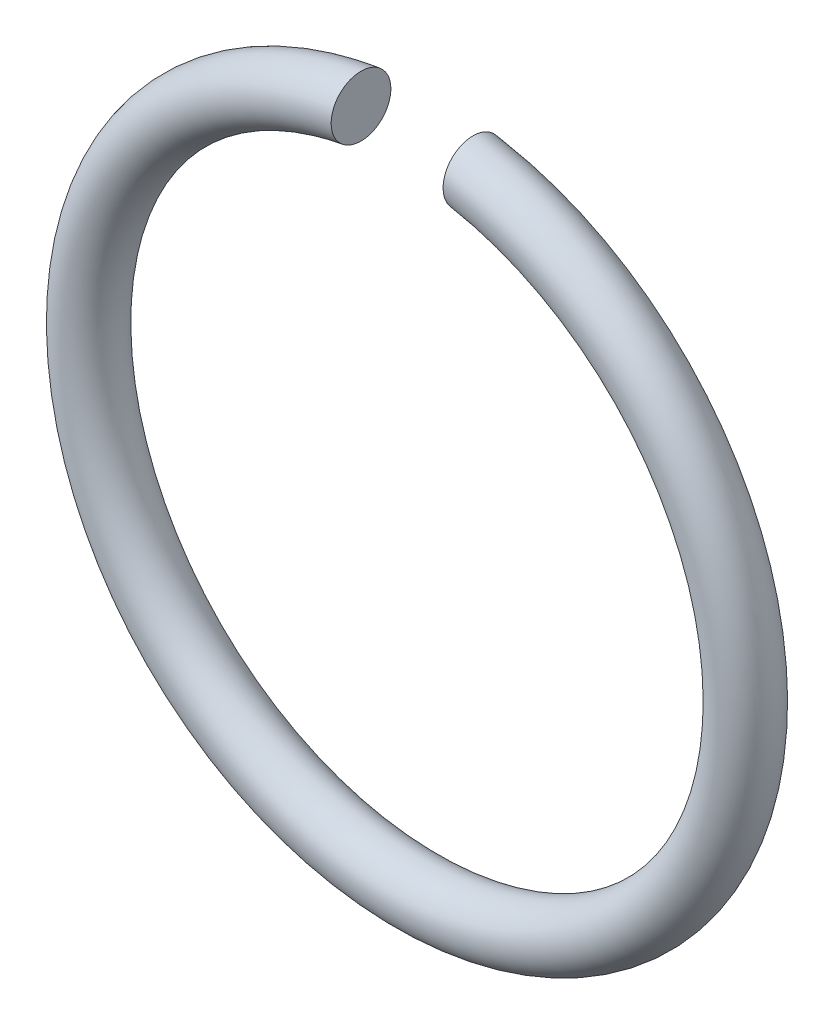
from build123d import *

# Parameters (mm, degrees)
SKETCH2_R               = 0.8
CUT_EXTRUDE1_DEPTH      = 14.600000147
CUT_EXTRUDE1_DEPTH_BACK = 14.600000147
SKETCH3_W               = 3
SKETCH3_H               = 9.6


with BuildPart() as part:
    # Base-Sweep: sweep along a path in Sketch1
    with BuildLine(Plane.XY) as base_sweep_path:
        CenterArc((0, 0), 8.8, 0, 360)
    # Sketch2 → Base-Sweep (sweep)
    with BuildSketch(Plane(origin=(0, 0, 0), x_dir=(1, 0, 0), z_dir=(0, 1, 0))):
        with Locations((8.8, 0)):
            Circle(SKETCH2_R)
    sweep(path=base_sweep_path.line)

    # Sketch3 → Cut-Extrude1 (cut, two sides: drawn at the far end of the back side and taken through both)
    with BuildSketch(Plane.XY.offset(-CUT_EXTRUDE1_DEPTH_BACK)):
        with Locations((0, 4.8)):
            Rectangle(SKETCH3_W, SKETCH3_H)
    extrude(amount=CUT_EXTRUDE1_DEPTH + CUT_EXTRUDE1_DEPTH_BACK, mode=Mode.SUBTRACT)


solid = part.part
